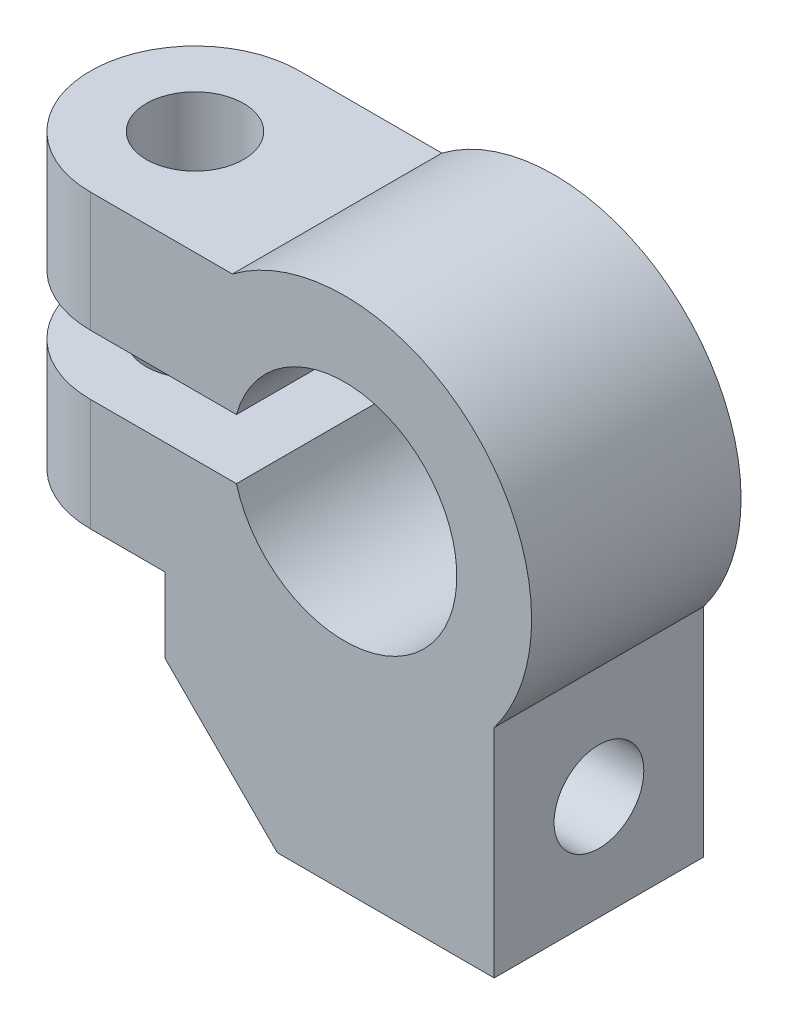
ISO-10303-21;
HEADER;
FILE_DESCRIPTION(('STEP AP214'),'2;1');
FILE_NAME('part.step','',(''),(''),'','','');
FILE_SCHEMA(('AUTOMOTIVE_DESIGN { 1 0 10303 214 1 1 1 1 }'));
ENDSEC;
DATA;
#1=APPLICATION_CONTEXT('core data for automotive mechanical design processes');
#2=APPLICATION_PROTOCOL_DEFINITION('international standard','automotive_design',2000,#1);
#3=PRODUCT_CONTEXT('',#1,'mechanical');
#4=PRODUCT('Part','Part','',(#3));
#5=PRODUCT_RELATED_PRODUCT_CATEGORY('part','',(#4));
#6=PRODUCT_DEFINITION_FORMATION('','',#4);
#7=PRODUCT_DEFINITION_CONTEXT('part definition',#1,'design');
#8=PRODUCT_DEFINITION('design','',#6,#7);
#9=PRODUCT_DEFINITION_SHAPE('','',#8);
#10=(LENGTH_UNIT() NAMED_UNIT(*) SI_UNIT(.MILLI.,.METRE.));
#11=(NAMED_UNIT(*) PLANE_ANGLE_UNIT() SI_UNIT($,.RADIAN.));
#12=(NAMED_UNIT(*) SI_UNIT($,.STERADIAN.) SOLID_ANGLE_UNIT());
#13=UNCERTAINTY_MEASURE_WITH_UNIT(LENGTH_MEASURE(1.E-05),#10,'distance_accuracy_value','');
#14=(GEOMETRIC_REPRESENTATION_CONTEXT(3) GLOBAL_UNCERTAINTY_ASSIGNED_CONTEXT((#13)) GLOBAL_UNIT_ASSIGNED_CONTEXT((#10,
#11,#12)) REPRESENTATION_CONTEXT('',''));
#15=CARTESIAN_POINT('',(0.,0.,0.));
#16=DIRECTION('',(0.,0.,1.));
#17=DIRECTION('',(1.,0.,0.));
#18=AXIS2_PLACEMENT_3D('',#15,#16,#17);
#19=CARTESIAN_POINT('',(-34.,-44.,14.));
#20=DIRECTION('',(0.,1.,0.));
#21=DIRECTION('',(0.,0.,1.));
#22=AXIS2_PLACEMENT_3D('',#19,#20,#21);
#23=CYLINDRICAL_SURFACE('',#22,14.);
#24=DIRECTION('',(0.,1.,0.));
#25=VECTOR('',#24,1.);
#26=CARTESIAN_POINT('',(-34.,-44.,28.));
#27=LINE('',#26,#25);
#28=CARTESIAN_POINT('',(-34.,-19.,28.));
#29=VERTEX_POINT('',#28);
#30=CARTESIAN_POINT('',(-34.,-4.00000000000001,28.));
#31=VERTEX_POINT('',#30);
#32=EDGE_CURVE('E176',#29,#31,#27,.T.);
#33=ORIENTED_EDGE('',*,*,#32,.T.);
#34=CARTESIAN_POINT('',(-34.,-4.,14.));
#35=DIRECTION('',(0.,-1.,0.));
#36=DIRECTION('',(0.,0.,-1.));
#37=AXIS2_PLACEMENT_3D('',#34,#35,#36);
#38=CIRCLE('',#37,14.);
#39=CARTESIAN_POINT('',(-34.,-4.00000000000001,0.));
#40=VERTEX_POINT('',#39);
#41=EDGE_CURVE('E13',#31,#40,#38,.T.);
#42=ORIENTED_EDGE('',*,*,#41,.T.);
#43=DIRECTION('',(0.,1.,0.));
#44=VECTOR('',#43,1.);
#45=CARTESIAN_POINT('',(-34.,0.,0.));
#46=LINE('',#45,#44);
#47=CARTESIAN_POINT('',(-34.,-19.,0.));
#48=VERTEX_POINT('',#47);
#49=EDGE_CURVE('E230',#48,#40,#46,.T.);
#50=ORIENTED_EDGE('',*,*,#49,.F.);
#51=CARTESIAN_POINT('',(-34.,-19.,14.));
#52=DIRECTION('',(0.,1.,0.));
#53=DIRECTION('',(0.,0.,1.));
#54=AXIS2_PLACEMENT_3D('',#51,#52,#53);
#55=CIRCLE('',#54,14.);
#56=EDGE_CURVE('E179',#29,#48,#55,.F.);
#57=ORIENTED_EDGE('',*,*,#56,.F.);
#58=EDGE_LOOP('',(#33,#42,#50,#57));
#59=FACE_BOUND('',#58,.T.);
#60=ADVANCED_FACE('F38',(#59),#23,.T.);
#61=CARTESIAN_POINT('',(-24.,-29.,28.));
#62=DIRECTION('',(0.707106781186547,0.707106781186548,0.));
#63=DIRECTION('',(-0.707106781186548,0.707106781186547,0.));
#64=AXIS2_PLACEMENT_3D('',#61,#62,#63);
#65=PLANE('',#64);
#66=DIRECTION('',(0.707106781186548,-0.707106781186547,0.));
#67=VECTOR('',#66,1.);
#68=CARTESIAN_POINT('',(-24.,-29.,0.));
#69=LINE('',#68,#67);
#70=CARTESIAN_POINT('',(-24.,-29.,0.));
#71=VERTEX_POINT('',#70);
#72=CARTESIAN_POINT('',(-8.99999999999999,-44.,0.));
#73=VERTEX_POINT('',#72);
#74=EDGE_CURVE('E182',#71,#73,#69,.T.);
#75=ORIENTED_EDGE('',*,*,#74,.T.);
#76=DIRECTION('',(0.,0.,-1.));
#77=VECTOR('',#76,1.);
#78=CARTESIAN_POINT('',(-8.99999999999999,-44.,28.));
#79=LINE('',#78,#77);
#80=CARTESIAN_POINT('',(-8.99999999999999,-44.,28.));
#81=VERTEX_POINT('',#80);
#82=EDGE_CURVE('E227',#81,#73,#79,.T.);
#83=ORIENTED_EDGE('',*,*,#82,.F.);
#84=DIRECTION('',(0.707106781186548,-0.707106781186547,0.));
#85=VECTOR('',#84,1.);
#86=CARTESIAN_POINT('',(-24.,-29.,28.));
#87=LINE('',#86,#85);
#88=CARTESIAN_POINT('',(-24.,-29.,28.));
#89=VERTEX_POINT('',#88);
#90=EDGE_CURVE('E198',#89,#81,#87,.T.);
#91=ORIENTED_EDGE('',*,*,#90,.F.);
#92=DIRECTION('',(0.,0.,-1.));
#93=VECTOR('',#92,1.);
#94=CARTESIAN_POINT('',(-24.,-29.,28.));
#95=LINE('',#94,#93);
#96=EDGE_CURVE('E212',#89,#71,#95,.T.);
#97=ORIENTED_EDGE('',*,*,#96,.T.);
#98=EDGE_LOOP('',(#75,#83,#91,#97));
#99=FACE_BOUND('',#98,.T.);
#100=ADVANCED_FACE('F40',(#99),#65,.F.);
#101=CARTESIAN_POINT('',(20.,-44.,28.));
#102=DIRECTION('',(0.,1.,0.));
#103=DIRECTION('',(-1.,0.,0.));
#104=AXIS2_PLACEMENT_3D('',#101,#102,#103);
#105=PLANE('',#104);
#106=DIRECTION('',(1.,0.,0.));
#107=VECTOR('',#106,1.);
#108=CARTESIAN_POINT('',(20.,-44.,0.));
#109=LINE('',#108,#107);
#110=CARTESIAN_POINT('',(20.,-44.,0.));
#111=VERTEX_POINT('',#110);
#112=EDGE_CURVE('E185',#73,#111,#109,.T.);
#113=ORIENTED_EDGE('',*,*,#112,.T.);
#114=DIRECTION('',(0.,0.,-1.));
#115=VECTOR('',#114,1.);
#116=CARTESIAN_POINT('',(20.,-44.,28.));
#117=LINE('',#116,#115);
#118=CARTESIAN_POINT('',(20.,-44.,28.));
#119=VERTEX_POINT('',#118);
#120=EDGE_CURVE('E224',#119,#111,#117,.T.);
#121=ORIENTED_EDGE('',*,*,#120,.F.);
#122=DIRECTION('',(1.,0.,0.));
#123=VECTOR('',#122,1.);
#124=CARTESIAN_POINT('',(20.,-44.,28.));
#125=LINE('',#124,#123);
#126=EDGE_CURVE('E200',#81,#119,#125,.T.);
#127=ORIENTED_EDGE('',*,*,#126,.F.);
#128=ORIENTED_EDGE('',*,*,#82,.T.);
#129=EDGE_LOOP('',(#113,#121,#127,#128));
#130=FACE_BOUND('',#129,.T.);
#131=ADVANCED_FACE('F260',(#130),#105,.F.);
#132=CARTESIAN_POINT('',(20.,-44.,28.));
#133=DIRECTION('',(-1.,0.,0.));
#134=DIRECTION('',(0.,-1.,0.));
#135=AXIS2_PLACEMENT_3D('',#132,#133,#134);
#136=PLANE('',#135);
#137=CARTESIAN_POINT('',(20.,-30.,14.));
#138=DIRECTION('',(1.,0.,0.));
#139=DIRECTION('',(0.,0.,-1.));
#140=AXIS2_PLACEMENT_3D('',#137,#138,#139);
#141=CIRCLE('',#140,6.);
#142=CARTESIAN_POINT('',(20.,-30.,8.));
#143=VERTEX_POINT('',#142);
#144=EDGE_CURVE('E142',#143,#143,#141,.T.);
#145=ORIENTED_EDGE('',*,*,#144,.F.);
#146=EDGE_LOOP('',(#145));
#147=FACE_BOUND('',#146,.T.);
#148=DIRECTION('',(0.,1.,0.));
#149=VECTOR('',#148,1.);
#150=CARTESIAN_POINT('',(20.,-44.,0.));
#151=LINE('',#150,#149);
#152=CARTESIAN_POINT('',(20.,-15.,0.));
#153=VERTEX_POINT('',#152);
#154=EDGE_CURVE('E187',#111,#153,#151,.T.);
#155=ORIENTED_EDGE('',*,*,#154,.T.);
#156=DIRECTION('',(0.,0.,-1.));
#157=VECTOR('',#156,1.);
#158=CARTESIAN_POINT('',(20.,-15.,28.));
#159=LINE('',#158,#157);
#160=CARTESIAN_POINT('',(20.,-15.,28.));
#161=VERTEX_POINT('',#160);
#162=EDGE_CURVE('E221',#161,#153,#159,.T.);
#163=ORIENTED_EDGE('',*,*,#162,.F.);
#164=DIRECTION('',(0.,1.,0.));
#165=VECTOR('',#164,1.);
#166=CARTESIAN_POINT('',(20.,-44.,28.));
#167=LINE('',#166,#165);
#168=EDGE_CURVE('E202',#119,#161,#167,.T.);
#169=ORIENTED_EDGE('',*,*,#168,.F.);
#170=ORIENTED_EDGE('',*,*,#120,.T.);
#171=EDGE_LOOP('',(#155,#163,#169,#170));
#172=FACE_BOUND('',#171,.T.);
#173=ADVANCED_FACE('F257',(#147,#172),#136,.F.);
#174=CARTESIAN_POINT('',(0.,0.,28.));
#175=DIRECTION('',(0.,0.,-1.));
#176=DIRECTION('',(-1.,0.,0.));
#177=AXIS2_PLACEMENT_3D('',#174,#175,#176);
#178=CYLINDRICAL_SURFACE('',#177,25.);
#179=CARTESIAN_POINT('',(0.,0.,0.));
#180=DIRECTION('',(0.,0.,1.));
#181=DIRECTION('',(1.,0.,0.));
#182=AXIS2_PLACEMENT_3D('',#179,#180,#181);
#183=CIRCLE('',#182,25.);
#184=CARTESIAN_POINT('',(-15.,20.,0.));
#185=VERTEX_POINT('',#184);
#186=EDGE_CURVE('E189',#153,#185,#183,.T.);
#187=ORIENTED_EDGE('',*,*,#186,.T.);
#188=DIRECTION('',(0.,0.,-1.));
#189=VECTOR('',#188,1.);
#190=CARTESIAN_POINT('',(-15.,20.,28.));
#191=LINE('',#190,#189);
#192=CARTESIAN_POINT('',(-15.,20.,28.));
#193=VERTEX_POINT('',#192);
#194=EDGE_CURVE('E218',#193,#185,#191,.T.);
#195=ORIENTED_EDGE('',*,*,#194,.F.);
#196=CARTESIAN_POINT('',(0.,0.,28.));
#197=DIRECTION('',(0.,0.,1.));
#198=DIRECTION('',(1.,0.,0.));
#199=AXIS2_PLACEMENT_3D('',#196,#197,#198);
#200=CIRCLE('',#199,25.);
#201=EDGE_CURVE('E204',#161,#193,#200,.T.);
#202=ORIENTED_EDGE('',*,*,#201,.F.);
#203=ORIENTED_EDGE('',*,*,#162,.T.);
#204=EDGE_LOOP('',(#187,#195,#202,#203));
#205=FACE_BOUND('',#204,.T.);
#206=ADVANCED_FACE('F253',(#205),#178,.T.);
#207=CARTESIAN_POINT('',(-48.,20.,28.));
#208=DIRECTION('',(0.,-1.,0.));
#209=DIRECTION('',(1.,0.,0.));
#210=AXIS2_PLACEMENT_3D('',#207,#208,#209);
#211=PLANE('',#210);
#212=CARTESIAN_POINT('',(-34.,20.,14.));
#213=DIRECTION('',(0.,1.,0.));
#214=DIRECTION('',(0.,0.,1.));
#215=AXIS2_PLACEMENT_3D('',#212,#213,#214);
#216=CIRCLE('',#215,6.49999999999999);
#217=CARTESIAN_POINT('',(-34.,20.,20.5));
#218=VERTEX_POINT('',#217);
#219=EDGE_CURVE('E386',#218,#218,#216,.T.);
#220=ORIENTED_EDGE('',*,*,#219,.F.);
#221=EDGE_LOOP('',(#220));
#222=FACE_BOUND('',#221,.T.);
#223=DIRECTION('',(-1.,0.,0.));
#224=VECTOR('',#223,1.);
#225=CARTESIAN_POINT('',(-48.,20.,0.));
#226=LINE('',#225,#224);
#227=CARTESIAN_POINT('',(-34.,20.,0.));
#228=VERTEX_POINT('',#227);
#229=EDGE_CURVE('E191',#185,#228,#226,.T.);
#230=ORIENTED_EDGE('',*,*,#229,.T.);
#231=CARTESIAN_POINT('',(-34.,20.,14.));
#232=DIRECTION('',(0.,-1.,0.));
#233=DIRECTION('',(0.,0.,1.));
#234=AXIS2_PLACEMENT_3D('',#231,#232,#233);
#235=CIRCLE('',#234,14.);
#236=CARTESIAN_POINT('',(-34.,20.,28.));
#237=VERTEX_POINT('',#236);
#238=EDGE_CURVE('E172',#237,#228,#235,.T.);
#239=ORIENTED_EDGE('',*,*,#238,.F.);
#240=DIRECTION('',(-1.,0.,0.));
#241=VECTOR('',#240,1.);
#242=CARTESIAN_POINT('',(-48.,20.,28.));
#243=LINE('',#242,#241);
#244=EDGE_CURVE('E206',#193,#237,#243,.T.);
#245=ORIENTED_EDGE('',*,*,#244,.F.);
#246=ORIENTED_EDGE('',*,*,#194,.T.);
#247=EDGE_LOOP('',(#230,#239,#245,#246));
#248=FACE_BOUND('',#247,.T.);
#249=ADVANCED_FACE('F248',(#222,#248),#211,.F.);
#250=CARTESIAN_POINT('',(-48.,-19.,28.));
#251=DIRECTION('',(0.,1.,0.));
#252=DIRECTION('',(0.,0.,1.));
#253=AXIS2_PLACEMENT_3D('',#250,#251,#252);
#254=PLANE('',#253);
#255=CARTESIAN_POINT('',(-34.,-19.,14.));
#256=DIRECTION('',(0.,1.,0.));
#257=DIRECTION('',(0.,0.,1.));
#258=AXIS2_PLACEMENT_3D('',#255,#256,#257);
#259=CIRCLE('',#258,6.49999999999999);
#260=CARTESIAN_POINT('',(-34.,-19.,20.5));
#261=VERTEX_POINT('',#260);
#262=EDGE_CURVE('E143',#261,#261,#259,.T.);
#263=ORIENTED_EDGE('',*,*,#262,.T.);
#264=EDGE_LOOP('',(#263));
#265=FACE_BOUND('',#264,.T.);
#266=DIRECTION('',(1.,0.,0.));
#267=VECTOR('',#266,1.);
#268=CARTESIAN_POINT('',(-48.,-19.,28.));
#269=LINE('',#268,#267);
#270=CARTESIAN_POINT('',(-24.,-19.,28.));
#271=VERTEX_POINT('',#270);
#272=EDGE_CURVE('E209',#29,#271,#269,.T.);
#273=ORIENTED_EDGE('',*,*,#272,.F.);
#274=ORIENTED_EDGE('',*,*,#56,.T.);
#275=DIRECTION('',(1.,0.,0.));
#276=VECTOR('',#275,1.);
#277=CARTESIAN_POINT('',(-48.,-19.,0.));
#278=LINE('',#277,#276);
#279=CARTESIAN_POINT('',(-24.,-19.,0.));
#280=VERTEX_POINT('',#279);
#281=EDGE_CURVE('E194',#48,#280,#278,.T.);
#282=ORIENTED_EDGE('',*,*,#281,.T.);
#283=DIRECTION('',(0.,0.,-1.));
#284=VECTOR('',#283,1.);
#285=CARTESIAN_POINT('',(-24.,-19.,28.));
#286=LINE('',#285,#284);
#287=EDGE_CURVE('E215',#271,#280,#286,.T.);
#288=ORIENTED_EDGE('',*,*,#287,.F.);
#289=EDGE_LOOP('',(#273,#274,#282,#288));
#290=FACE_BOUND('',#289,.T.);
#291=ADVANCED_FACE('F272',(#265,#290),#254,.F.);
#292=CARTESIAN_POINT('',(-24.,-19.,28.));
#293=DIRECTION('',(1.,0.,0.));
#294=DIRECTION('',(0.,1.,0.));
#295=AXIS2_PLACEMENT_3D('',#292,#293,#294);
#296=PLANE('',#295);
#297=DIRECTION('',(0.,-1.,0.));
#298=VECTOR('',#297,1.);
#299=CARTESIAN_POINT('',(-24.,-19.,0.));
#300=LINE('',#299,#298);
#301=EDGE_CURVE('E196',#280,#71,#300,.T.);
#302=ORIENTED_EDGE('',*,*,#301,.T.);
#303=ORIENTED_EDGE('',*,*,#96,.F.);
#304=DIRECTION('',(0.,-1.,0.));
#305=VECTOR('',#304,1.);
#306=CARTESIAN_POINT('',(-24.,-19.,28.));
#307=LINE('',#306,#305);
#308=EDGE_CURVE('E62',#271,#89,#307,.T.);
#309=ORIENTED_EDGE('',*,*,#308,.F.);
#310=ORIENTED_EDGE('',*,*,#287,.T.);
#311=EDGE_LOOP('',(#302,#303,#309,#310));
#312=FACE_BOUND('',#311,.T.);
#313=ADVANCED_FACE('F268',(#312),#296,.F.);
#314=CARTESIAN_POINT('',(0.,0.,28.));
#315=DIRECTION('',(0.,0.,1.));
#316=DIRECTION('',(1.,0.,0.));
#317=AXIS2_PLACEMENT_3D('',#314,#315,#316);
#318=PLANE('',#317);
#319=DIRECTION('',(1.,0.,0.));
#320=VECTOR('',#319,1.);
#321=CARTESIAN_POINT('',(-48.,-4.00000000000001,28.));
#322=LINE('',#321,#320);
#323=CARTESIAN_POINT('',(-14.456832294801,-4.00000000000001,28.));
#324=VERTEX_POINT('',#323);
#325=EDGE_CURVE('E158',#31,#324,#322,.T.);
#326=ORIENTED_EDGE('',*,*,#325,.F.);
#327=ORIENTED_EDGE('',*,*,#32,.F.);
#328=ORIENTED_EDGE('',*,*,#272,.T.);
#329=ORIENTED_EDGE('',*,*,#308,.T.);
#330=ORIENTED_EDGE('',*,*,#90,.T.);
#331=ORIENTED_EDGE('',*,*,#126,.T.);
#332=ORIENTED_EDGE('',*,*,#168,.T.);
#333=ORIENTED_EDGE('',*,*,#201,.T.);
#334=ORIENTED_EDGE('',*,*,#244,.T.);
#335=CARTESIAN_POINT('',(-34.,4.,28.));
#336=VERTEX_POINT('',#335);
#337=EDGE_CURVE('E175',#336,#237,#27,.T.);
#338=ORIENTED_EDGE('',*,*,#337,.F.);
#339=DIRECTION('',(-1.,0.,0.));
#340=VECTOR('',#339,1.);
#341=CARTESIAN_POINT('',(-14.456832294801,4.,28.));
#342=LINE('',#341,#340);
#343=CARTESIAN_POINT('',(-14.456832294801,4.,28.));
#344=VERTEX_POINT('',#343);
#345=EDGE_CURVE('E155',#344,#336,#342,.T.);
#346=ORIENTED_EDGE('',*,*,#345,.F.);
#347=CARTESIAN_POINT('',(0.,0.,28.));
#348=DIRECTION('',(0.,0.,1.));
#349=DIRECTION('',(1.,0.,0.));
#350=AXIS2_PLACEMENT_3D('',#347,#348,#349);
#351=CIRCLE('',#350,15.);
#352=EDGE_CURVE('E146',#324,#344,#351,.T.);
#353=ORIENTED_EDGE('',*,*,#352,.F.);
#354=EDGE_LOOP('',(#326,#327,#328,#329,#330,#331,#332,#333,#334,#338,#346,#353));
#355=FACE_BOUND('',#354,.T.);
#356=ADVANCED_FACE('F243',(#355),#318,.T.);
#357=CARTESIAN_POINT('',(0.,0.,0.));
#358=DIRECTION('',(0.,0.,1.));
#359=DIRECTION('',(1.,0.,0.));
#360=AXIS2_PLACEMENT_3D('',#357,#358,#359);
#361=PLANE('',#360);
#362=ORIENTED_EDGE('',*,*,#49,.T.);
#363=DIRECTION('',(1.,0.,0.));
#364=VECTOR('',#363,1.);
#365=CARTESIAN_POINT('',(-48.,-4.00000000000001,0.));
#366=LINE('',#365,#364);
#367=CARTESIAN_POINT('',(-14.456832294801,-4.00000000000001,0.));
#368=VERTEX_POINT('',#367);
#369=EDGE_CURVE('E165',#40,#368,#366,.T.);
#370=ORIENTED_EDGE('',*,*,#369,.T.);
#371=CARTESIAN_POINT('',(0.,0.,0.));
#372=DIRECTION('',(0.,0.,1.));
#373=DIRECTION('',(1.,0.,0.));
#374=AXIS2_PLACEMENT_3D('',#371,#372,#373);
#375=CIRCLE('',#374,15.);
#376=CARTESIAN_POINT('',(-14.456832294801,4.,0.));
#377=VERTEX_POINT('',#376);
#378=EDGE_CURVE('E160',#368,#377,#375,.T.);
#379=ORIENTED_EDGE('',*,*,#378,.T.);
#380=DIRECTION('',(-1.,0.,0.));
#381=VECTOR('',#380,1.);
#382=CARTESIAN_POINT('',(-14.456832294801,4.,0.));
#383=LINE('',#382,#381);
#384=CARTESIAN_POINT('',(-34.,4.,0.));
#385=VERTEX_POINT('',#384);
#386=EDGE_CURVE('E163',#377,#385,#383,.T.);
#387=ORIENTED_EDGE('',*,*,#386,.T.);
#388=EDGE_CURVE('E54',#385,#228,#46,.T.);
#389=ORIENTED_EDGE('',*,*,#388,.T.);
#390=ORIENTED_EDGE('',*,*,#229,.F.);
#391=ORIENTED_EDGE('',*,*,#186,.F.);
#392=ORIENTED_EDGE('',*,*,#154,.F.);
#393=ORIENTED_EDGE('',*,*,#112,.F.);
#394=ORIENTED_EDGE('',*,*,#74,.F.);
#395=ORIENTED_EDGE('',*,*,#301,.F.);
#396=ORIENTED_EDGE('',*,*,#281,.F.);
#397=EDGE_LOOP('',(#362,#370,#379,#387,#389,#390,#391,#392,#393,#394,#395,#396));
#398=FACE_BOUND('',#397,.T.);
#399=ADVANCED_FACE('F250',(#398),#361,.F.);
#400=CARTESIAN_POINT('',(-34.,4.,14.));
#401=DIRECTION('',(0.,1.,0.));
#402=DIRECTION('',(-1.,0.,0.));
#403=AXIS2_PLACEMENT_3D('',#400,#401,#402);
#404=CIRCLE('',#403,14.);
#405=EDGE_CURVE('E47',#385,#336,#404,.T.);
#406=ORIENTED_EDGE('',*,*,#405,.T.);
#407=ORIENTED_EDGE('',*,*,#337,.T.);
#408=ORIENTED_EDGE('',*,*,#238,.T.);
#409=ORIENTED_EDGE('',*,*,#388,.F.);
#410=EDGE_LOOP('',(#406,#407,#408,#409));
#411=FACE_BOUND('',#410,.T.);
#412=ADVANCED_FACE('F234',(#411),#23,.T.);
#413=CARTESIAN_POINT('',(-48.,-4.00000000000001,0.));
#414=DIRECTION('',(0.,-1.,0.));
#415=DIRECTION('',(0.,0.,-1.));
#416=AXIS2_PLACEMENT_3D('',#413,#414,#415);
#417=PLANE('',#416);
#418=CARTESIAN_POINT('',(-34.,-4.00000000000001,14.));
#419=DIRECTION('',(0.,-1.,0.));
#420=DIRECTION('',(0.,0.,-1.));
#421=AXIS2_PLACEMENT_3D('',#418,#419,#420);
#422=CIRCLE('',#421,6.49999999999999);
#423=CARTESIAN_POINT('',(-34.,-4.00000000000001,7.50000000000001));
#424=VERTEX_POINT('',#423);
#425=EDGE_CURVE('E149',#424,#424,#422,.T.);
#426=ORIENTED_EDGE('',*,*,#425,.T.);
#427=EDGE_LOOP('',(#426));
#428=FACE_BOUND('',#427,.T.);
#429=ORIENTED_EDGE('',*,*,#325,.T.);
#430=DIRECTION('',(0.,0.,1.));
#431=VECTOR('',#430,1.);
#432=CARTESIAN_POINT('',(-14.456832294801,-4.00000000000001,0.));
#433=LINE('',#432,#431);
#434=EDGE_CURVE('E169',#368,#324,#433,.T.);
#435=ORIENTED_EDGE('',*,*,#434,.F.);
#436=ORIENTED_EDGE('',*,*,#369,.F.);
#437=ORIENTED_EDGE('',*,*,#41,.F.);
#438=EDGE_LOOP('',(#429,#435,#436,#437));
#439=FACE_BOUND('',#438,.T.);
#440=ADVANCED_FACE('F276',(#428,#439),#417,.F.);
#441=CARTESIAN_POINT('',(-14.456832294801,4.,0.));
#442=DIRECTION('',(0.,1.,0.));
#443=DIRECTION('',(-1.,0.,0.));
#444=AXIS2_PLACEMENT_3D('',#441,#442,#443);
#445=PLANE('',#444);
#446=CARTESIAN_POINT('',(-34.,4.,14.));
#447=DIRECTION('',(0.,1.,0.));
#448=DIRECTION('',(-1.,0.,0.));
#449=AXIS2_PLACEMENT_3D('',#446,#447,#448);
#450=CIRCLE('',#449,6.49999999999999);
#451=CARTESIAN_POINT('',(-40.5,4.,14.));
#452=VERTEX_POINT('',#451);
#453=EDGE_CURVE('E42',#452,#452,#450,.T.);
#454=ORIENTED_EDGE('',*,*,#453,.T.);
#455=EDGE_LOOP('',(#454));
#456=FACE_BOUND('',#455,.T.);
#457=ORIENTED_EDGE('',*,*,#405,.F.);
#458=ORIENTED_EDGE('',*,*,#386,.F.);
#459=DIRECTION('',(0.,0.,1.));
#460=VECTOR('',#459,1.);
#461=CARTESIAN_POINT('',(-14.456832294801,4.,0.));
#462=LINE('',#461,#460);
#463=EDGE_CURVE('E168',#377,#344,#462,.T.);
#464=ORIENTED_EDGE('',*,*,#463,.T.);
#465=ORIENTED_EDGE('',*,*,#345,.T.);
#466=EDGE_LOOP('',(#457,#458,#464,#465));
#467=FACE_BOUND('',#466,.T.);
#468=ADVANCED_FACE('F240',(#456,#467),#445,.F.);
#469=CARTESIAN_POINT('',(0.,0.,0.));
#470=DIRECTION('',(0.,0.,1.));
#471=DIRECTION('',(1.,0.,0.));
#472=AXIS2_PLACEMENT_3D('',#469,#470,#471);
#473=CYLINDRICAL_SURFACE('',#472,15.);
#474=ORIENTED_EDGE('',*,*,#352,.T.);
#475=ORIENTED_EDGE('',*,*,#463,.F.);
#476=ORIENTED_EDGE('',*,*,#378,.F.);
#477=ORIENTED_EDGE('',*,*,#434,.T.);
#478=EDGE_LOOP('',(#474,#475,#476,#477));
#479=FACE_BOUND('',#478,.T.);
#480=ADVANCED_FACE('F278',(#479),#473,.F.);
#481=CARTESIAN_POINT('',(20.,-30.,14.));
#482=DIRECTION('',(1.,0.,0.));
#483=DIRECTION('',(0.,0.,-1.));
#484=AXIS2_PLACEMENT_3D('',#481,#482,#483);
#485=CYLINDRICAL_SURFACE('',#484,6.);
#486=CARTESIAN_POINT('',(2.,-30.,14.));
#487=DIRECTION('',(1.,0.,0.));
#488=DIRECTION('',(0.,0.,-1.));
#489=AXIS2_PLACEMENT_3D('',#486,#487,#488);
#490=CIRCLE('',#489,5.99999999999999);
#491=CARTESIAN_POINT('',(2.,-30.,8.00000000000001));
#492=VERTEX_POINT('',#491);
#493=EDGE_CURVE('E140',#492,#492,#490,.T.);
#494=ORIENTED_EDGE('',*,*,#493,.F.);
#495=EDGE_LOOP('',(#494));
#496=FACE_BOUND('',#495,.T.);
#497=ORIENTED_EDGE('',*,*,#144,.T.);
#498=EDGE_LOOP('',(#497));
#499=FACE_BOUND('',#498,.T.);
#500=ADVANCED_FACE('F136',(#496,#499),#485,.F.);
#501=CARTESIAN_POINT('',(2.,-30.,14.));
#502=DIRECTION('',(1.,0.,0.));
#503=DIRECTION('',(0.,0.,-1.));
#504=AXIS2_PLACEMENT_3D('',#501,#502,#503);
#505=CONICAL_SURFACE('',#504,5.99999999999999,1.02974425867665);
#506=CARTESIAN_POINT('',(-1.60516371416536,-30.,14.));
#507=VERTEX_POINT('',#506);
#508=VERTEX_LOOP('',#507);
#509=FACE_BOUND('',#508,.T.);
#510=ORIENTED_EDGE('',*,*,#493,.T.);
#511=EDGE_LOOP('',(#510));
#512=FACE_BOUND('',#511,.T.);
#513=ADVANCED_FACE('F132',(#509,#512),#505,.F.);
#514=CARTESIAN_POINT('',(-34.,20.,14.));
#515=DIRECTION('',(0.,1.,0.));
#516=DIRECTION('',(0.,0.,1.));
#517=AXIS2_PLACEMENT_3D('',#514,#515,#516);
#518=CYLINDRICAL_SURFACE('',#517,6.49999999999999);
#519=ORIENTED_EDGE('',*,*,#219,.T.);
#520=EDGE_LOOP('',(#519));
#521=FACE_BOUND('',#520,.T.);
#522=ORIENTED_EDGE('',*,*,#453,.F.);
#523=EDGE_LOOP('',(#522));
#524=FACE_BOUND('',#523,.T.);
#525=ADVANCED_FACE('F135',(#521,#524),#518,.F.);
#526=ORIENTED_EDGE('',*,*,#425,.F.);
#527=EDGE_LOOP('',(#526));
#528=FACE_BOUND('',#527,.T.);
#529=ORIENTED_EDGE('',*,*,#262,.F.);
#530=EDGE_LOOP('',(#529));
#531=FACE_BOUND('',#530,.T.);
#532=ADVANCED_FACE('F372',(#528,#531),#518,.F.);
#533=CLOSED_SHELL('',(#60,#100,#131,#173,#206,#249,#291,#313,#356,#399,#412,#440,#468,#480,#500,
#513,#525,#532));
#534=MANIFOLD_SOLID_BREP('B2',#533);
#535=ADVANCED_BREP_SHAPE_REPRESENTATION('',(#18,#534),#14);
#536=SHAPE_DEFINITION_REPRESENTATION(#9,#535);
ENDSEC;
END-ISO-10303-21;
